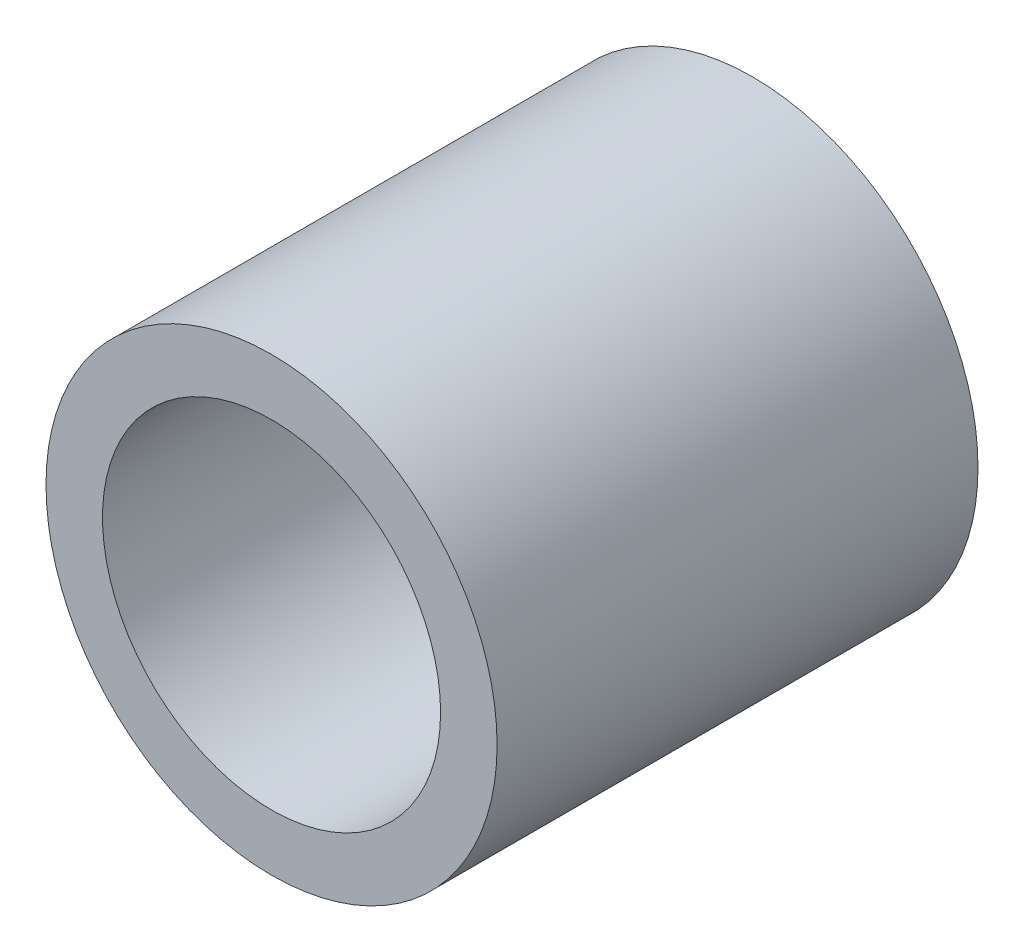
ISO-10303-21;
HEADER;
FILE_DESCRIPTION(('STEP AP214'),'2;1');
FILE_NAME('part.step','',(''),(''),'','','');
FILE_SCHEMA(('AUTOMOTIVE_DESIGN { 1 0 10303 214 1 1 1 1 }'));
ENDSEC;
DATA;
#1=APPLICATION_CONTEXT('core data for automotive mechanical design processes');
#2=APPLICATION_PROTOCOL_DEFINITION('international standard','automotive_design',2000,#1);
#3=PRODUCT_CONTEXT('',#1,'mechanical');
#4=PRODUCT('Part','Part','',(#3));
#5=PRODUCT_RELATED_PRODUCT_CATEGORY('part','',(#4));
#6=PRODUCT_DEFINITION_FORMATION('','',#4);
#7=PRODUCT_DEFINITION_CONTEXT('part definition',#1,'design');
#8=PRODUCT_DEFINITION('design','',#6,#7);
#9=PRODUCT_DEFINITION_SHAPE('','',#8);
#10=(LENGTH_UNIT() NAMED_UNIT(*) SI_UNIT(.MILLI.,.METRE.));
#11=(NAMED_UNIT(*) PLANE_ANGLE_UNIT() SI_UNIT($,.RADIAN.));
#12=(NAMED_UNIT(*) SI_UNIT($,.STERADIAN.) SOLID_ANGLE_UNIT());
#13=UNCERTAINTY_MEASURE_WITH_UNIT(LENGTH_MEASURE(1.E-05),#10,'distance_accuracy_value','');
#14=(GEOMETRIC_REPRESENTATION_CONTEXT(3) GLOBAL_UNCERTAINTY_ASSIGNED_CONTEXT((#13)) GLOBAL_UNIT_ASSIGNED_CONTEXT((#10,
#11,#12)) REPRESENTATION_CONTEXT('',''));
#15=CARTESIAN_POINT('',(0.,0.,0.));
#16=DIRECTION('',(0.,0.,1.));
#17=DIRECTION('',(1.,0.,0.));
#18=AXIS2_PLACEMENT_3D('',#15,#16,#17);
#19=CARTESIAN_POINT('',(0.,0.,6.35));
#20=DIRECTION('',(0.,0.,1.));
#21=DIRECTION('',(1.,0.,0.));
#22=AXIS2_PLACEMENT_3D('',#19,#20,#21);
#23=PLANE('',#22);
#24=CARTESIAN_POINT('',(0.,0.,6.35));
#25=DIRECTION('',(0.,0.,1.));
#26=DIRECTION('',(1.,0.,0.));
#27=AXIS2_PLACEMENT_3D('',#24,#25,#26);
#28=CIRCLE('',#27,5.9563);
#29=CARTESIAN_POINT('',(5.9563,0.,6.35));
#30=VERTEX_POINT('',#29);
#31=EDGE_CURVE('E10',#30,#30,#28,.T.);
#32=ORIENTED_EDGE('',*,*,#31,.T.);
#33=EDGE_LOOP('',(#32));
#34=FACE_BOUND('',#33,.T.);
#35=CARTESIAN_POINT('',(0.,0.,6.35));
#36=DIRECTION('',(0.,0.,1.));
#37=DIRECTION('',(1.,0.,0.));
#38=AXIS2_PLACEMENT_3D('',#35,#36,#37);
#39=CIRCLE('',#38,4.46405);
#40=CARTESIAN_POINT('',(4.46405,0.,6.35));
#41=VERTEX_POINT('',#40);
#42=EDGE_CURVE('E45',#41,#41,#39,.T.);
#43=ORIENTED_EDGE('',*,*,#42,.F.);
#44=EDGE_LOOP('',(#43));
#45=FACE_BOUND('',#44,.T.);
#46=ADVANCED_FACE('F34',(#34,#45),#23,.T.);
#47=CARTESIAN_POINT('',(0.,0.,-6.35));
#48=DIRECTION('',(0.,0.,1.));
#49=DIRECTION('',(1.,0.,0.));
#50=AXIS2_PLACEMENT_3D('',#47,#48,#49);
#51=PLANE('',#50);
#52=CARTESIAN_POINT('',(0.,0.,-6.35));
#53=DIRECTION('',(0.,0.,1.));
#54=DIRECTION('',(1.,0.,0.));
#55=AXIS2_PLACEMENT_3D('',#52,#53,#54);
#56=CIRCLE('',#55,5.9563);
#57=CARTESIAN_POINT('',(5.9563,0.,-6.35));
#58=VERTEX_POINT('',#57);
#59=EDGE_CURVE('E38',#58,#58,#56,.T.);
#60=ORIENTED_EDGE('',*,*,#59,.F.);
#61=EDGE_LOOP('',(#60));
#62=FACE_BOUND('',#61,.T.);
#63=CARTESIAN_POINT('',(0.,0.,-6.35));
#64=DIRECTION('',(0.,0.,1.));
#65=DIRECTION('',(1.,0.,0.));
#66=AXIS2_PLACEMENT_3D('',#63,#64,#65);
#67=CIRCLE('',#66,4.46405);
#68=CARTESIAN_POINT('',(4.46405,0.,-6.35));
#69=VERTEX_POINT('',#68);
#70=EDGE_CURVE('E47',#69,#69,#67,.T.);
#71=ORIENTED_EDGE('',*,*,#70,.T.);
#72=EDGE_LOOP('',(#71));
#73=FACE_BOUND('',#72,.T.);
#74=ADVANCED_FACE('F57',(#62,#73),#51,.F.);
#75=CARTESIAN_POINT('',(0.,0.,6.35));
#76=DIRECTION('',(0.,0.,-1.));
#77=DIRECTION('',(-1.,0.,0.));
#78=AXIS2_PLACEMENT_3D('',#75,#76,#77);
#79=CYLINDRICAL_SURFACE('',#78,5.9563);
#80=ORIENTED_EDGE('',*,*,#31,.F.);
#81=EDGE_LOOP('',(#80));
#82=FACE_BOUND('',#81,.T.);
#83=ORIENTED_EDGE('',*,*,#59,.T.);
#84=EDGE_LOOP('',(#83));
#85=FACE_BOUND('',#84,.T.);
#86=ADVANCED_FACE('F36',(#82,#85),#79,.T.);
#87=CARTESIAN_POINT('',(0.,0.,6.35));
#88=DIRECTION('',(0.,0.,-1.));
#89=DIRECTION('',(-1.,0.,0.));
#90=AXIS2_PLACEMENT_3D('',#87,#88,#89);
#91=CYLINDRICAL_SURFACE('',#90,4.46405);
#92=ORIENTED_EDGE('',*,*,#42,.T.);
#93=EDGE_LOOP('',(#92));
#94=FACE_BOUND('',#93,.T.);
#95=ORIENTED_EDGE('',*,*,#70,.F.);
#96=EDGE_LOOP('',(#95));
#97=FACE_BOUND('',#96,.T.);
#98=ADVANCED_FACE('F53',(#94,#97),#91,.F.);
#99=CLOSED_SHELL('',(#46,#74,#86,#98));
#100=MANIFOLD_SOLID_BREP('B2',#99);
#101=ADVANCED_BREP_SHAPE_REPRESENTATION('',(#18,#100),#14);
#102=SHAPE_DEFINITION_REPRESENTATION(#9,#101);
ENDSEC;
END-ISO-10303-21;
